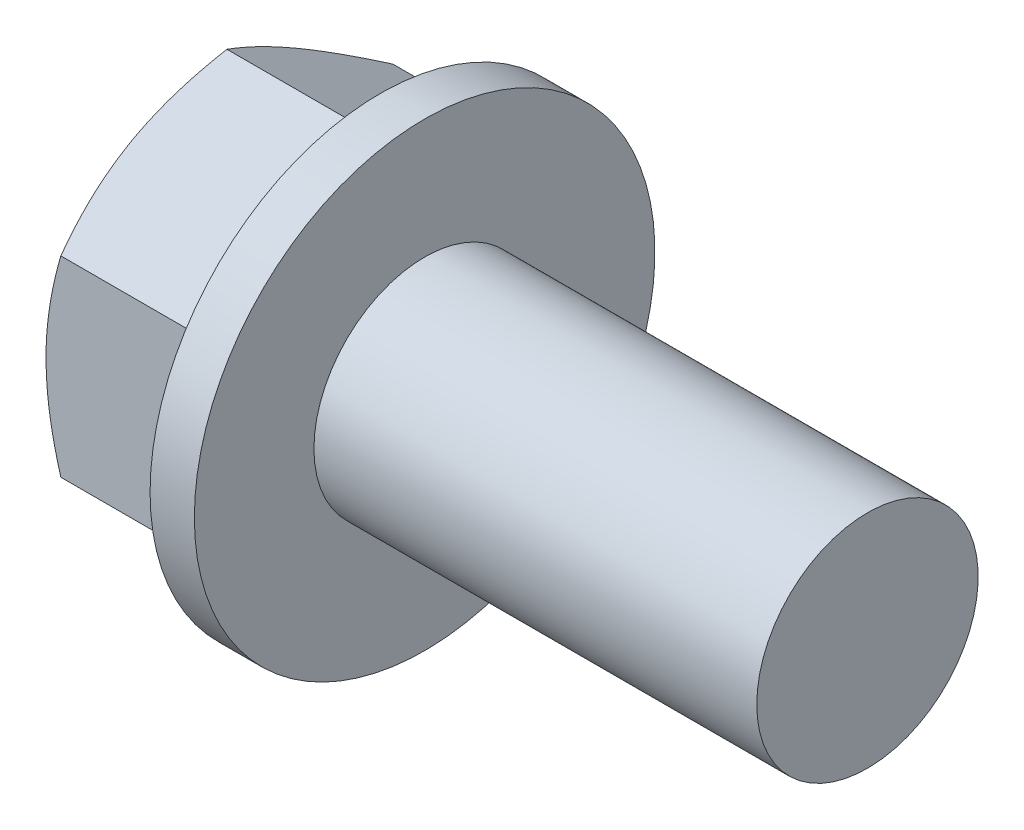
from build123d import *

# Parameters (mm, degrees)
SKETCH2_R     = 6.67004
HEX_DIE_DEPTH = 4.826
SKETCH4_R     = 4.1671875
INDENT_DEPTH  = 0.60325


with BuildPart() as part:
    # BodySke → Base-Revolve (revolve)
    with BuildSketch(Plane.XY, mode=Mode.PRIVATE) as base_revolve_sk:
        Polygon((6.096, 3.175), (6.096, 6.604), (4.826, 6.604), (4.826, 5.499422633), (0.42546248, 5.499422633), (0, 4.7625), (0, 0), (18.796, 0), (18.796, 3.175), align=None)
    revolve(base_revolve_sk.sketch.rotate(Axis((-25.4, 0, 0), (1, 0, 0)), 90), axis=Axis((-25.4, 0, 0), (1, 0, 0)))

    # Sketch2 → Hex-Die (cut)
    with BuildSketch(Plane(origin=(0, 0, 0), x_dir=(0, 0, -1), z_dir=(1, 0, 0))):
        Circle(SKETCH2_R)
        Polygon((-4.7625, 2.749630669), (0, 5.499261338), (4.7625, 2.749630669), (4.7625, -2.749630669), (0, -5.499261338), (-4.7625, -2.749630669), align=None, mode=Mode.SUBTRACT)
    extrude(amount=HEX_DIE_DEPTH, mode=Mode.SUBTRACT)

    # Sketch4 → Indent (cut)
    with BuildSketch(Plane(origin=(0, 0, 0), x_dir=(0, 0, -1), z_dir=(1, 0, 0))):
        Circle(SKETCH4_R)
    extrude(amount=INDENT_DEPTH, mode=Mode.SUBTRACT)


solid = part.part
